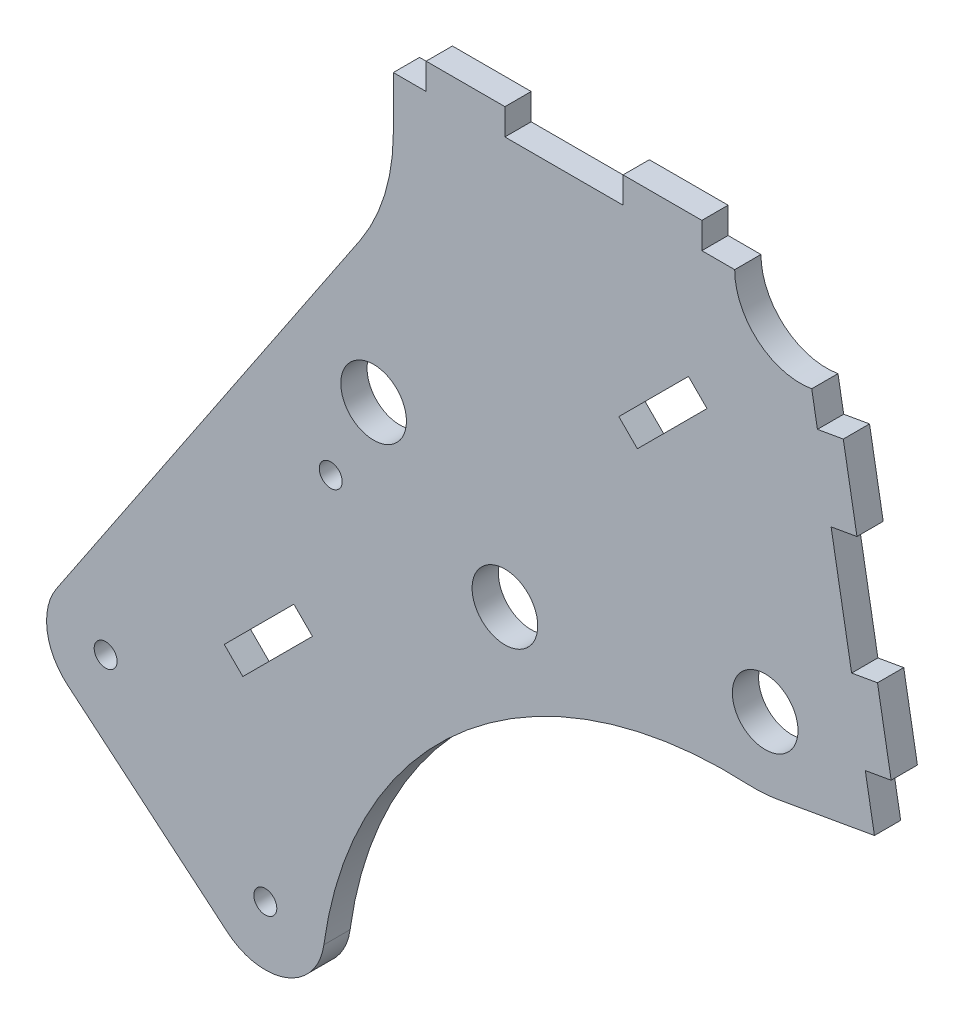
from build123d import *

# Parameters (mm, degrees)
SKETCH1_R           = 1.75
SKETCH1_R_2         = 5
BOSS_EXTRUDE1_DEPTH = 4


with BuildPart() as part:
    # Sketch1 → Boss-Extrude1 (new body)
    with BuildSketch(Plane.XY):
        with BuildLine():
            Line((-10, 0), (-15, 0))
            Line((-15, 0), (-15, 4))
            Line((-15, 4), (-27, 4))
            Line((-27, 4), (-27, 0))
            Line((-27, 0), (-45, 0))
            Line((-45, 0), (-45, 4))
            Line((-45, 4), (-57, 4))
            Line((-57, 4), (-57, 0))
            Line((-57, 0), (-62, 0))
            Line((-62, 0), (-62, -8))
            ThreePointArc((-62, -8), (-63.296167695, -16.722958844), (-67.0726674, -24.692156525))
            Line((-67.0726674, -24.692156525), (-113.29702211, -93.721575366))
            ThreePointArc((-113.29702211, -93.721575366), (-114.729118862, -99.99674578), (-111.603910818, -105.623622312))
            Line((-111.603910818, -105.623622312), (-87.281999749, -126.032128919))
            ThreePointArc((-87.281999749, -126.032128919), (-78.259317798, -127.535227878), (-72.580873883, -120.364218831))
            ThreePointArc((-72.580873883, -120.364218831), (-50.692355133, -81.052129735), (-7.982664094, -66.894803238))
            ThreePointArc((-7.982664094, -66.894803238), (-5.725981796, -66.883091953), (-3.484984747, -66.617226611))
            Line((-3.484984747, -66.617226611), (11.287131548, -64.012503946))
            Line((11.287131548, -64.012503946), (9.897946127, -56.134041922))
            Line((9.897946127, -56.134041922), (13.837177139, -55.439449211))
            Line((13.837177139, -55.439449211), (11.753399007, -43.621756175))
            Line((11.753399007, -43.621756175), (7.814167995, -44.316348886))
            Line((7.814167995, -44.316348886), (4.688500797, -26.589809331))
            Line((4.688500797, -26.589809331), (8.627731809, -25.895216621))
            Line((8.627731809, -25.895216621), (6.543953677, -14.077523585))
            Line((6.543953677, -14.077523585), (2.604722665, -14.772116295))
            Line((2.604722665, -14.772116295), (1.736481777, -9.84807753))
            ThreePointArc((1.736481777, -9.84807753), (-6.427876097, -7.660444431), (-10, 0))
        make_face()
        with Locations((-81.496911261, -119.137728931)):
            Circle(SKETCH1_R, mode=Mode.SUBTRACT)
        with Locations((-105.81882233, -98.729222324)):
            Circle(SKETCH1_R, mode=Mode.SUBTRACT)
        with Locations((-71.53253123, -57.868411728)):
            Circle(SKETCH1_R, mode=Mode.SUBTRACT)
        with Locations((-5.357088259, -56)):
            Circle(SKETCH1_R_2, mode=Mode.SUBTRACT)
        with Locations((-65, -45)):
            Circle(SKETCH1_R_2, mode=Mode.SUBTRACT)
        with Locations((-45, -62)):
            Circle(SKETCH1_R_2, mode=Mode.SUBTRACT)
        Polygon((-77.145349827, -77.711035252), (-87.751951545, -88.31763697), (-84.923524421, -91.146064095), (-74.316922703, -80.539462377), align=None, mode=Mode.SUBTRACT)
        Polygon((-27.647875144, -28.213560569), (-17.041273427, -17.606958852), (-14.212846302, -20.435385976), (-24.81944802, -31.041987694), align=None, mode=Mode.SUBTRACT)
    extrude(amount=BOSS_EXTRUDE1_DEPTH)


solid = part.part
